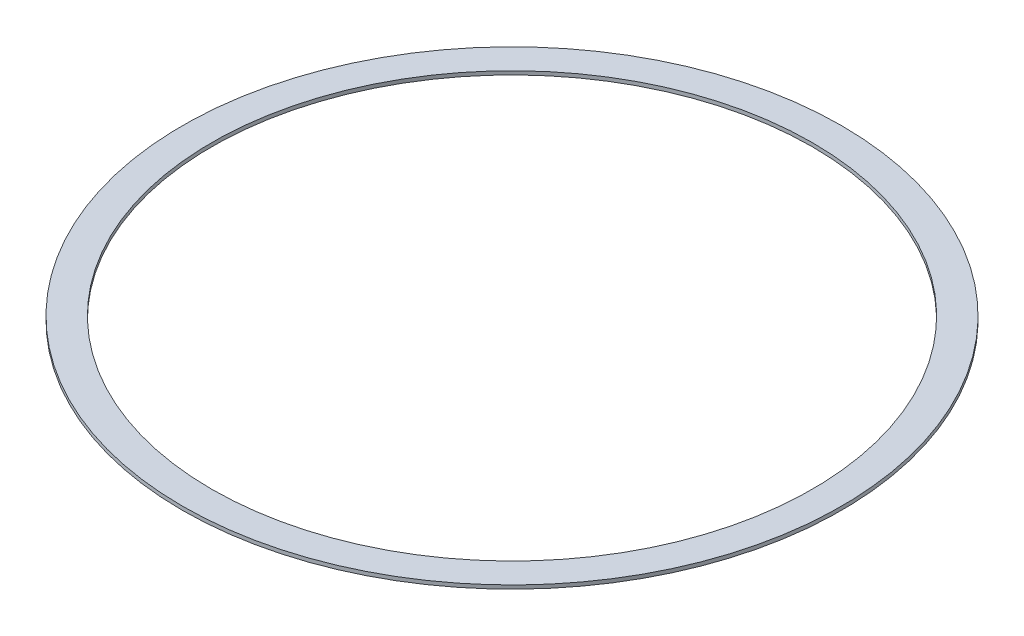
ISO-10303-21;
HEADER;
FILE_DESCRIPTION(('STEP AP214'),'2;1');
FILE_NAME('part.step','',(''),(''),'','','');
FILE_SCHEMA(('AUTOMOTIVE_DESIGN { 1 0 10303 214 1 1 1 1 }'));
ENDSEC;
DATA;
#1=APPLICATION_CONTEXT('core data for automotive mechanical design processes');
#2=APPLICATION_PROTOCOL_DEFINITION('international standard','automotive_design',2000,#1);
#3=PRODUCT_CONTEXT('',#1,'mechanical');
#4=PRODUCT('Part','Part','',(#3));
#5=PRODUCT_RELATED_PRODUCT_CATEGORY('part','',(#4));
#6=PRODUCT_DEFINITION_FORMATION('','',#4);
#7=PRODUCT_DEFINITION_CONTEXT('part definition',#1,'design');
#8=PRODUCT_DEFINITION('design','',#6,#7);
#9=PRODUCT_DEFINITION_SHAPE('','',#8);
#10=(LENGTH_UNIT() NAMED_UNIT(*) SI_UNIT(.MILLI.,.METRE.));
#11=(NAMED_UNIT(*) PLANE_ANGLE_UNIT() SI_UNIT($,.RADIAN.));
#12=(NAMED_UNIT(*) SI_UNIT($,.STERADIAN.) SOLID_ANGLE_UNIT());
#13=UNCERTAINTY_MEASURE_WITH_UNIT(LENGTH_MEASURE(1.E-05),#10,'distance_accuracy_value','');
#14=(GEOMETRIC_REPRESENTATION_CONTEXT(3) GLOBAL_UNCERTAINTY_ASSIGNED_CONTEXT((#13)) GLOBAL_UNIT_ASSIGNED_CONTEXT((#10,
#11,#12)) REPRESENTATION_CONTEXT('',''));
#15=CARTESIAN_POINT('',(0.,0.,0.));
#16=DIRECTION('',(0.,0.,1.));
#17=DIRECTION('',(1.,0.,0.));
#18=AXIS2_PLACEMENT_3D('',#15,#16,#17);
#19=CARTESIAN_POINT('',(0.,0.5,0.));
#20=DIRECTION('',(0.,1.,0.));
#21=DIRECTION('',(0.,0.,1.));
#22=AXIS2_PLACEMENT_3D('',#19,#20,#21);
#23=PLANE('',#22);
#24=CARTESIAN_POINT('',(0.,0.5,0.));
#25=DIRECTION('',(0.,1.,0.));
#26=DIRECTION('',(0.,0.,1.));
#27=AXIS2_PLACEMENT_3D('',#24,#25,#26);
#28=CIRCLE('',#27,45.);
#29=CARTESIAN_POINT('',(0.,0.5,45.));
#30=VERTEX_POINT('',#29);
#31=EDGE_CURVE('E10',#30,#30,#28,.T.);
#32=ORIENTED_EDGE('',*,*,#31,.T.);
#33=EDGE_LOOP('',(#32));
#34=FACE_BOUND('',#33,.T.);
#35=CARTESIAN_POINT('',(0.,0.5,0.));
#36=DIRECTION('',(0.,1.,0.));
#37=DIRECTION('',(0.,0.,1.));
#38=AXIS2_PLACEMENT_3D('',#35,#36,#37);
#39=CIRCLE('',#38,41.);
#40=CARTESIAN_POINT('',(0.,0.5,41.));
#41=VERTEX_POINT('',#40);
#42=EDGE_CURVE('E44',#41,#41,#39,.T.);
#43=ORIENTED_EDGE('',*,*,#42,.F.);
#44=EDGE_LOOP('',(#43));
#45=FACE_BOUND('',#44,.T.);
#46=ADVANCED_FACE('F33',(#34,#45),#23,.T.);
#47=CARTESIAN_POINT('',(0.,0.,0.));
#48=DIRECTION('',(0.,1.,0.));
#49=DIRECTION('',(0.,0.,1.));
#50=AXIS2_PLACEMENT_3D('',#47,#48,#49);
#51=PLANE('',#50);
#52=CARTESIAN_POINT('',(0.,0.,0.));
#53=DIRECTION('',(0.,1.,0.));
#54=DIRECTION('',(0.,0.,1.));
#55=AXIS2_PLACEMENT_3D('',#52,#53,#54);
#56=CIRCLE('',#55,45.);
#57=CARTESIAN_POINT('',(0.,0.,45.));
#58=VERTEX_POINT('',#57);
#59=EDGE_CURVE('E37',#58,#58,#56,.T.);
#60=ORIENTED_EDGE('',*,*,#59,.F.);
#61=EDGE_LOOP('',(#60));
#62=FACE_BOUND('',#61,.T.);
#63=CARTESIAN_POINT('',(0.,0.,0.));
#64=DIRECTION('',(0.,1.,0.));
#65=DIRECTION('',(0.,0.,1.));
#66=AXIS2_PLACEMENT_3D('',#63,#64,#65);
#67=CIRCLE('',#66,41.);
#68=CARTESIAN_POINT('',(0.,0.,41.));
#69=VERTEX_POINT('',#68);
#70=EDGE_CURVE('E46',#69,#69,#67,.T.);
#71=ORIENTED_EDGE('',*,*,#70,.T.);
#72=EDGE_LOOP('',(#71));
#73=FACE_BOUND('',#72,.T.);
#74=ADVANCED_FACE('F56',(#62,#73),#51,.F.);
#75=CARTESIAN_POINT('',(0.,0.5,0.));
#76=DIRECTION('',(0.,-1.,0.));
#77=DIRECTION('',(0.,0.,-1.));
#78=AXIS2_PLACEMENT_3D('',#75,#76,#77);
#79=CYLINDRICAL_SURFACE('',#78,45.);
#80=ORIENTED_EDGE('',*,*,#31,.F.);
#81=EDGE_LOOP('',(#80));
#82=FACE_BOUND('',#81,.T.);
#83=ORIENTED_EDGE('',*,*,#59,.T.);
#84=EDGE_LOOP('',(#83));
#85=FACE_BOUND('',#84,.T.);
#86=ADVANCED_FACE('F35',(#82,#85),#79,.T.);
#87=CARTESIAN_POINT('',(0.,0.5,0.));
#88=DIRECTION('',(0.,-1.,0.));
#89=DIRECTION('',(0.,0.,-1.));
#90=AXIS2_PLACEMENT_3D('',#87,#88,#89);
#91=CYLINDRICAL_SURFACE('',#90,41.);
#92=ORIENTED_EDGE('',*,*,#42,.T.);
#93=EDGE_LOOP('',(#92));
#94=FACE_BOUND('',#93,.T.);
#95=ORIENTED_EDGE('',*,*,#70,.F.);
#96=EDGE_LOOP('',(#95));
#97=FACE_BOUND('',#96,.T.);
#98=ADVANCED_FACE('F52',(#94,#97),#91,.F.);
#99=CLOSED_SHELL('',(#46,#74,#86,#98));
#100=MANIFOLD_SOLID_BREP('B2',#99);
#101=ADVANCED_BREP_SHAPE_REPRESENTATION('',(#18,#100),#14);
#102=SHAPE_DEFINITION_REPRESENTATION(#9,#101);
ENDSEC;
END-ISO-10303-21;
